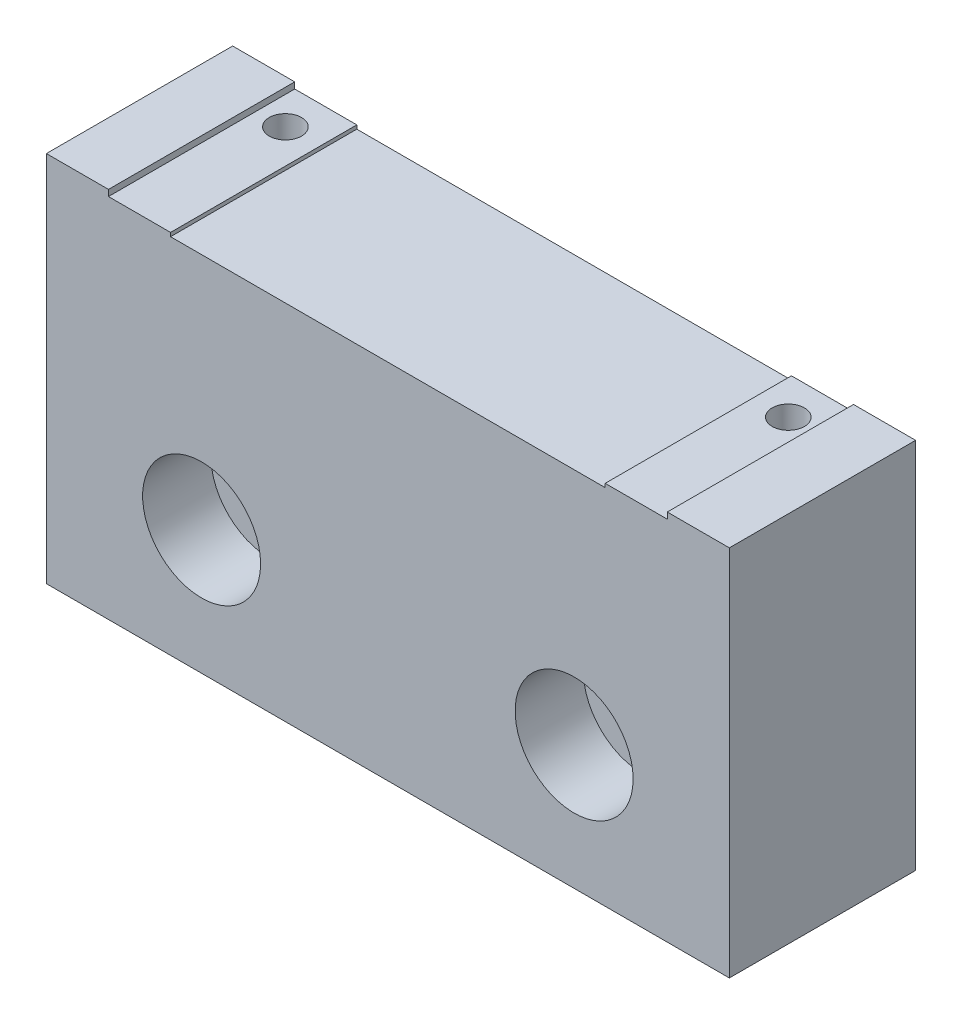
ISO-10303-21;
HEADER;
FILE_DESCRIPTION(('STEP AP214'),'2;1');
FILE_NAME('part.step','',(''),(''),'','','');
FILE_SCHEMA(('AUTOMOTIVE_DESIGN { 1 0 10303 214 1 1 1 1 }'));
ENDSEC;
DATA;
#1=APPLICATION_CONTEXT('core data for automotive mechanical design processes');
#2=APPLICATION_PROTOCOL_DEFINITION('international standard','automotive_design',2000,#1);
#3=PRODUCT_CONTEXT('',#1,'mechanical');
#4=PRODUCT('Part','Part','',(#3));
#5=PRODUCT_RELATED_PRODUCT_CATEGORY('part','',(#4));
#6=PRODUCT_DEFINITION_FORMATION('','',#4);
#7=PRODUCT_DEFINITION_CONTEXT('part definition',#1,'design');
#8=PRODUCT_DEFINITION('design','',#6,#7);
#9=PRODUCT_DEFINITION_SHAPE('','',#8);
#10=(LENGTH_UNIT() NAMED_UNIT(*) SI_UNIT(.MILLI.,.METRE.));
#11=(NAMED_UNIT(*) PLANE_ANGLE_UNIT() SI_UNIT($,.RADIAN.));
#12=(NAMED_UNIT(*) SI_UNIT($,.STERADIAN.) SOLID_ANGLE_UNIT());
#13=UNCERTAINTY_MEASURE_WITH_UNIT(LENGTH_MEASURE(1.E-05),#10,'distance_accuracy_value','');
#14=(GEOMETRIC_REPRESENTATION_CONTEXT(3) GLOBAL_UNCERTAINTY_ASSIGNED_CONTEXT((#13)) GLOBAL_UNIT_ASSIGNED_CONTEXT((#10,
#11,#12)) REPRESENTATION_CONTEXT('',''));
#15=CARTESIAN_POINT('',(0.,0.,0.));
#16=DIRECTION('',(0.,0.,1.));
#17=DIRECTION('',(1.,0.,0.));
#18=AXIS2_PLACEMENT_3D('',#15,#16,#17);
#19=CARTESIAN_POINT('',(42.5,10.,15.));
#20=DIRECTION('',(0.,0.,-1.));
#21=DIRECTION('',(-1.,0.,0.));
#22=AXIS2_PLACEMENT_3D('',#19,#20,#21);
#23=CYLINDRICAL_SURFACE('',#22,2.75);
#24=CARTESIAN_POINT('',(42.5,10.,0.));
#25=DIRECTION('',(0.,0.,1.));
#26=DIRECTION('',(1.,0.,0.));
#27=AXIS2_PLACEMENT_3D('',#24,#25,#26);
#28=CIRCLE('',#27,2.75);
#29=CARTESIAN_POINT('',(45.25,10.,0.));
#30=VERTEX_POINT('',#29);
#31=EDGE_CURVE('E205',#30,#30,#28,.T.);
#32=ORIENTED_EDGE('',*,*,#31,.F.);
#33=EDGE_LOOP('',(#32));
#34=FACE_BOUND('',#33,.T.);
#35=CARTESIAN_POINT('',(42.5,10.,9.5));
#36=DIRECTION('',(0.,0.,1.));
#37=DIRECTION('',(1.,0.,0.));
#38=AXIS2_PLACEMENT_3D('',#35,#36,#37);
#39=CIRCLE('',#38,2.75);
#40=CARTESIAN_POINT('',(45.25,10.,9.5));
#41=VERTEX_POINT('',#40);
#42=EDGE_CURVE('E207',#41,#41,#39,.T.);
#43=ORIENTED_EDGE('',*,*,#42,.T.);
#44=EDGE_LOOP('',(#43));
#45=FACE_BOUND('',#44,.T.);
#46=ADVANCED_FACE('F32',(#34,#45),#23,.F.);
#47=CARTESIAN_POINT('',(12.5,10.,15.));
#48=DIRECTION('',(0.,0.,-1.));
#49=DIRECTION('',(-1.,0.,0.));
#50=AXIS2_PLACEMENT_3D('',#47,#48,#49);
#51=CYLINDRICAL_SURFACE('',#50,2.75);
#52=CARTESIAN_POINT('',(12.5,10.,0.));
#53=DIRECTION('',(0.,0.,1.));
#54=DIRECTION('',(1.,0.,0.));
#55=AXIS2_PLACEMENT_3D('',#52,#53,#54);
#56=CIRCLE('',#55,2.75);
#57=CARTESIAN_POINT('',(15.25,10.,0.));
#58=VERTEX_POINT('',#57);
#59=EDGE_CURVE('E159',#58,#58,#56,.T.);
#60=ORIENTED_EDGE('',*,*,#59,.F.);
#61=EDGE_LOOP('',(#60));
#62=FACE_BOUND('',#61,.T.);
#63=CARTESIAN_POINT('',(12.5,10.,9.5));
#64=DIRECTION('',(0.,0.,1.));
#65=DIRECTION('',(1.,0.,0.));
#66=AXIS2_PLACEMENT_3D('',#63,#64,#65);
#67=CIRCLE('',#66,2.75);
#68=CARTESIAN_POINT('',(15.25,10.,9.5));
#69=VERTEX_POINT('',#68);
#70=EDGE_CURVE('E202',#69,#69,#67,.T.);
#71=ORIENTED_EDGE('',*,*,#70,.T.);
#72=EDGE_LOOP('',(#71));
#73=FACE_BOUND('',#72,.T.);
#74=ADVANCED_FACE('F282',(#62,#73),#51,.F.);
#75=CARTESIAN_POINT('',(55.,0.,15.));
#76=DIRECTION('',(0.,0.,1.));
#77=DIRECTION('',(1.,0.,0.));
#78=AXIS2_PLACEMENT_3D('',#75,#76,#77);
#79=PLANE('',#78);
#80=CARTESIAN_POINT('',(42.5,10.,15.));
#81=DIRECTION('',(0.,0.,1.));
#82=DIRECTION('',(1.,0.,0.));
#83=AXIS2_PLACEMENT_3D('',#80,#81,#82);
#84=CIRCLE('',#83,4.75);
#85=CARTESIAN_POINT('',(47.25,10.,15.));
#86=VERTEX_POINT('',#85);
#87=EDGE_CURVE('E213',#86,#86,#84,.T.);
#88=ORIENTED_EDGE('',*,*,#87,.F.);
#89=EDGE_LOOP('',(#88));
#90=FACE_BOUND('',#89,.T.);
#91=CARTESIAN_POINT('',(12.5,10.,15.));
#92=DIRECTION('',(0.,0.,1.));
#93=DIRECTION('',(1.,0.,0.));
#94=AXIS2_PLACEMENT_3D('',#91,#92,#93);
#95=CIRCLE('',#94,4.75);
#96=CARTESIAN_POINT('',(17.25,10.,15.));
#97=VERTEX_POINT('',#96);
#98=EDGE_CURVE('E209',#97,#97,#95,.T.);
#99=ORIENTED_EDGE('',*,*,#98,.F.);
#100=EDGE_LOOP('',(#99));
#101=FACE_BOUND('',#100,.T.);
#102=DIRECTION('',(1.,0.,0.));
#103=VECTOR('',#102,1.);
#104=CARTESIAN_POINT('',(0.,0.,15.));
#105=LINE('',#104,#103);
#106=CARTESIAN_POINT('',(0.,0.,15.));
#107=VERTEX_POINT('',#106);
#108=CARTESIAN_POINT('',(55.,0.,15.));
#109=VERTEX_POINT('',#108);
#110=EDGE_CURVE('E178',#107,#109,#105,.T.);
#111=ORIENTED_EDGE('',*,*,#110,.T.);
#112=DIRECTION('',(0.,1.,0.));
#113=VECTOR('',#112,1.);
#114=CARTESIAN_POINT('',(55.,0.,15.));
#115=LINE('',#114,#113);
#116=CARTESIAN_POINT('',(55.,30.,15.));
#117=VERTEX_POINT('',#116);
#118=EDGE_CURVE('E106',#109,#117,#115,.T.);
#119=ORIENTED_EDGE('',*,*,#118,.T.);
#120=DIRECTION('',(-1.,0.,0.));
#121=VECTOR('',#120,1.);
#122=CARTESIAN_POINT('',(50.,30.,15.));
#123=LINE('',#122,#121);
#124=CARTESIAN_POINT('',(50.,30.,15.));
#125=VERTEX_POINT('',#124);
#126=EDGE_CURVE('E239',#117,#125,#123,.T.);
#127=ORIENTED_EDGE('',*,*,#126,.T.);
#128=DIRECTION('',(0.,-1.,0.));
#129=VECTOR('',#128,1.);
#130=CARTESIAN_POINT('',(50.,29.5,15.));
#131=LINE('',#130,#129);
#132=CARTESIAN_POINT('',(50.,29.5,15.));
#133=VERTEX_POINT('',#132);
#134=EDGE_CURVE('E241',#125,#133,#131,.T.);
#135=ORIENTED_EDGE('',*,*,#134,.T.);
#136=DIRECTION('',(-1.,0.,0.));
#137=VECTOR('',#136,1.);
#138=CARTESIAN_POINT('',(45.,29.4999999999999,15.));
#139=LINE('',#138,#137);
#140=CARTESIAN_POINT('',(45.,29.4999999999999,15.));
#141=VERTEX_POINT('',#140);
#142=EDGE_CURVE('E243',#133,#141,#139,.T.);
#143=ORIENTED_EDGE('',*,*,#142,.T.);
#144=DIRECTION('',(0.,-1.,0.));
#145=VECTOR('',#144,1.);
#146=CARTESIAN_POINT('',(45.,29.2,15.));
#147=LINE('',#146,#145);
#148=CARTESIAN_POINT('',(45.,29.2,15.));
#149=VERTEX_POINT('',#148);
#150=EDGE_CURVE('E245',#141,#149,#147,.T.);
#151=ORIENTED_EDGE('',*,*,#150,.T.);
#152=DIRECTION('',(-1.,0.,0.));
#153=VECTOR('',#152,1.);
#154=CARTESIAN_POINT('',(10.,29.2,15.));
#155=LINE('',#154,#153);
#156=CARTESIAN_POINT('',(10.,29.2,15.));
#157=VERTEX_POINT('',#156);
#158=EDGE_CURVE('E247',#149,#157,#155,.T.);
#159=ORIENTED_EDGE('',*,*,#158,.T.);
#160=DIRECTION('',(0.,1.,0.));
#161=VECTOR('',#160,1.);
#162=CARTESIAN_POINT('',(10.,29.2,15.));
#163=LINE('',#162,#161);
#164=CARTESIAN_POINT('',(10.,29.5,15.));
#165=VERTEX_POINT('',#164);
#166=EDGE_CURVE('E249',#157,#165,#163,.T.);
#167=ORIENTED_EDGE('',*,*,#166,.T.);
#168=DIRECTION('',(-1.,0.,0.));
#169=VECTOR('',#168,1.);
#170=CARTESIAN_POINT('',(5.,29.5,15.));
#171=LINE('',#170,#169);
#172=CARTESIAN_POINT('',(5.,29.5,15.));
#173=VERTEX_POINT('',#172);
#174=EDGE_CURVE('E137',#165,#173,#171,.T.);
#175=ORIENTED_EDGE('',*,*,#174,.T.);
#176=DIRECTION('',(0.,1.,0.));
#177=VECTOR('',#176,1.);
#178=CARTESIAN_POINT('',(5.,29.5,15.));
#179=LINE('',#178,#177);
#180=CARTESIAN_POINT('',(5.,30.,15.));
#181=VERTEX_POINT('',#180);
#182=EDGE_CURVE('E131',#173,#181,#179,.T.);
#183=ORIENTED_EDGE('',*,*,#182,.T.);
#184=DIRECTION('',(-1.,0.,0.));
#185=VECTOR('',#184,1.);
#186=CARTESIAN_POINT('',(0.,30.,15.));
#187=LINE('',#186,#185);
#188=CARTESIAN_POINT('',(0.,30.,15.));
#189=VERTEX_POINT('',#188);
#190=EDGE_CURVE('E135',#181,#189,#187,.T.);
#191=ORIENTED_EDGE('',*,*,#190,.T.);
#192=DIRECTION('',(0.,-1.,0.));
#193=VECTOR('',#192,1.);
#194=CARTESIAN_POINT('',(0.,0.,15.));
#195=LINE('',#194,#193);
#196=EDGE_CURVE('E51',#189,#107,#195,.T.);
#197=ORIENTED_EDGE('',*,*,#196,.T.);
#198=EDGE_LOOP('',(#111,#119,#127,#135,#143,#151,#159,#167,#175,#183,#191,#197));
#199=FACE_BOUND('',#198,.T.);
#200=ADVANCED_FACE('F133',(#90,#101,#199),#79,.T.);
#201=CARTESIAN_POINT('',(55.,0.,0.));
#202=DIRECTION('',(0.,0.,1.));
#203=DIRECTION('',(1.,0.,0.));
#204=AXIS2_PLACEMENT_3D('',#201,#202,#203);
#205=PLANE('',#204);
#206=ORIENTED_EDGE('',*,*,#59,.T.);
#207=EDGE_LOOP('',(#206));
#208=FACE_BOUND('',#207,.T.);
#209=DIRECTION('',(1.,0.,0.));
#210=VECTOR('',#209,1.);
#211=CARTESIAN_POINT('',(0.,0.,0.));
#212=LINE('',#211,#210);
#213=CARTESIAN_POINT('',(0.,0.,0.));
#214=VERTEX_POINT('',#213);
#215=CARTESIAN_POINT('',(55.,0.,0.));
#216=VERTEX_POINT('',#215);
#217=EDGE_CURVE('E155',#214,#216,#212,.T.);
#218=ORIENTED_EDGE('',*,*,#217,.F.);
#219=DIRECTION('',(0.,-1.,0.));
#220=VECTOR('',#219,1.);
#221=CARTESIAN_POINT('',(0.,0.,0.));
#222=LINE('',#221,#220);
#223=CARTESIAN_POINT('',(0.,30.,0.));
#224=VERTEX_POINT('',#223);
#225=EDGE_CURVE('E98',#224,#214,#222,.T.);
#226=ORIENTED_EDGE('',*,*,#225,.F.);
#227=DIRECTION('',(-1.,0.,0.));
#228=VECTOR('',#227,1.);
#229=CARTESIAN_POINT('',(0.,30.,0.));
#230=LINE('',#229,#228);
#231=CARTESIAN_POINT('',(5.,30.,0.));
#232=VERTEX_POINT('',#231);
#233=EDGE_CURVE('E92',#232,#224,#230,.T.);
#234=ORIENTED_EDGE('',*,*,#233,.F.);
#235=DIRECTION('',(0.,1.,0.));
#236=VECTOR('',#235,1.);
#237=CARTESIAN_POINT('',(5.,29.5,0.));
#238=LINE('',#237,#236);
#239=CARTESIAN_POINT('',(5.,29.5,0.));
#240=VERTEX_POINT('',#239);
#241=EDGE_CURVE('E145',#240,#232,#238,.T.);
#242=ORIENTED_EDGE('',*,*,#241,.F.);
#243=DIRECTION('',(-1.,0.,0.));
#244=VECTOR('',#243,1.);
#245=CARTESIAN_POINT('',(5.,29.5,0.));
#246=LINE('',#245,#244);
#247=CARTESIAN_POINT('',(10.,29.5,0.));
#248=VERTEX_POINT('',#247);
#249=EDGE_CURVE('E173',#248,#240,#246,.T.);
#250=ORIENTED_EDGE('',*,*,#249,.F.);
#251=DIRECTION('',(0.,1.,0.));
#252=VECTOR('',#251,1.);
#253=CARTESIAN_POINT('',(10.,29.2,0.));
#254=LINE('',#253,#252);
#255=CARTESIAN_POINT('',(10.,29.2,0.));
#256=VERTEX_POINT('',#255);
#257=EDGE_CURVE('E171',#256,#248,#254,.T.);
#258=ORIENTED_EDGE('',*,*,#257,.F.);
#259=DIRECTION('',(-1.,0.,0.));
#260=VECTOR('',#259,1.);
#261=CARTESIAN_POINT('',(10.,29.2,0.));
#262=LINE('',#261,#260);
#263=CARTESIAN_POINT('',(45.,29.2,0.));
#264=VERTEX_POINT('',#263);
#265=EDGE_CURVE('E169',#264,#256,#262,.T.);
#266=ORIENTED_EDGE('',*,*,#265,.F.);
#267=DIRECTION('',(0.,-1.,0.));
#268=VECTOR('',#267,1.);
#269=CARTESIAN_POINT('',(45.,29.2,0.));
#270=LINE('',#269,#268);
#271=CARTESIAN_POINT('',(45.,29.4999999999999,0.));
#272=VERTEX_POINT('',#271);
#273=EDGE_CURVE('E167',#272,#264,#270,.T.);
#274=ORIENTED_EDGE('',*,*,#273,.F.);
#275=DIRECTION('',(-1.,0.,0.));
#276=VECTOR('',#275,1.);
#277=CARTESIAN_POINT('',(45.,29.4999999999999,0.));
#278=LINE('',#277,#276);
#279=CARTESIAN_POINT('',(50.,29.5,0.));
#280=VERTEX_POINT('',#279);
#281=EDGE_CURVE('E165',#280,#272,#278,.T.);
#282=ORIENTED_EDGE('',*,*,#281,.F.);
#283=DIRECTION('',(0.,-1.,0.));
#284=VECTOR('',#283,1.);
#285=CARTESIAN_POINT('',(50.,29.5,0.));
#286=LINE('',#285,#284);
#287=CARTESIAN_POINT('',(50.,30.,0.));
#288=VERTEX_POINT('',#287);
#289=EDGE_CURVE('E163',#288,#280,#286,.T.);
#290=ORIENTED_EDGE('',*,*,#289,.F.);
#291=DIRECTION('',(-1.,0.,0.));
#292=VECTOR('',#291,1.);
#293=CARTESIAN_POINT('',(50.,30.,0.));
#294=LINE('',#293,#292);
#295=CARTESIAN_POINT('',(55.,30.,0.));
#296=VERTEX_POINT('',#295);
#297=EDGE_CURVE('E161',#296,#288,#294,.T.);
#298=ORIENTED_EDGE('',*,*,#297,.F.);
#299=DIRECTION('',(0.,1.,0.));
#300=VECTOR('',#299,1.);
#301=CARTESIAN_POINT('',(55.,0.,0.));
#302=LINE('',#301,#300);
#303=EDGE_CURVE('E158',#216,#296,#302,.T.);
#304=ORIENTED_EDGE('',*,*,#303,.F.);
#305=EDGE_LOOP('',(#218,#226,#234,#242,#250,#258,#266,#274,#282,#290,#298,#304));
#306=FACE_BOUND('',#305,.T.);
#307=ORIENTED_EDGE('',*,*,#31,.T.);
#308=EDGE_LOOP('',(#307));
#309=FACE_BOUND('',#308,.T.);
#310=ADVANCED_FACE('F262',(#208,#306,#309),#205,.F.);
#311=CARTESIAN_POINT('',(0.,0.,15.));
#312=DIRECTION('',(0.,1.,0.));
#313=DIRECTION('',(0.,0.,1.));
#314=AXIS2_PLACEMENT_3D('',#311,#312,#313);
#315=PLANE('',#314);
#316=CARTESIAN_POINT('',(7.2587228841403,0.,3.0120402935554));
#317=DIRECTION('',(0.,1.,0.));
#318=DIRECTION('',(0.,0.,1.));
#319=AXIS2_PLACEMENT_3D('',#316,#317,#318);
#320=CIRCLE('',#319,1.3);
#321=CARTESIAN_POINT('',(7.2587228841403,0.,4.3120402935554));
#322=VERTEX_POINT('',#321);
#323=EDGE_CURVE('E224',#322,#322,#320,.T.);
#324=ORIENTED_EDGE('',*,*,#323,.T.);
#325=EDGE_LOOP('',(#324));
#326=FACE_BOUND('',#325,.T.);
#327=CARTESIAN_POINT('',(47.7587228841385,0.,3.0120402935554));
#328=DIRECTION('',(0.,1.,0.));
#329=DIRECTION('',(0.,0.,1.));
#330=AXIS2_PLACEMENT_3D('',#327,#328,#329);
#331=CIRCLE('',#330,1.3);
#332=CARTESIAN_POINT('',(47.7587228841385,0.,4.3120402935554));
#333=VERTEX_POINT('',#332);
#334=EDGE_CURVE('E214',#333,#333,#331,.T.);
#335=ORIENTED_EDGE('',*,*,#334,.T.);
#336=EDGE_LOOP('',(#335));
#337=FACE_BOUND('',#336,.T.);
#338=ORIENTED_EDGE('',*,*,#217,.T.);
#339=DIRECTION('',(0.,0.,-1.));
#340=VECTOR('',#339,1.);
#341=CARTESIAN_POINT('',(55.,0.,15.));
#342=LINE('',#341,#340);
#343=EDGE_CURVE('E11',#109,#216,#342,.T.);
#344=ORIENTED_EDGE('',*,*,#343,.F.);
#345=ORIENTED_EDGE('',*,*,#110,.F.);
#346=DIRECTION('',(0.,0.,-1.));
#347=VECTOR('',#346,1.);
#348=CARTESIAN_POINT('',(0.,0.,15.));
#349=LINE('',#348,#347);
#350=EDGE_CURVE('E151',#107,#214,#349,.T.);
#351=ORIENTED_EDGE('',*,*,#350,.T.);
#352=EDGE_LOOP('',(#338,#344,#345,#351));
#353=FACE_BOUND('',#352,.T.);
#354=ADVANCED_FACE('F34',(#326,#337,#353),#315,.F.);
#355=CARTESIAN_POINT('',(55.,0.,15.));
#356=DIRECTION('',(-1.,0.,0.));
#357=DIRECTION('',(0.,0.,1.));
#358=AXIS2_PLACEMENT_3D('',#355,#356,#357);
#359=PLANE('',#358);
#360=ORIENTED_EDGE('',*,*,#303,.T.);
#361=DIRECTION('',(0.,0.,-1.));
#362=VECTOR('',#361,1.);
#363=CARTESIAN_POINT('',(55.,30.,15.));
#364=LINE('',#363,#362);
#365=EDGE_CURVE('E42',#117,#296,#364,.T.);
#366=ORIENTED_EDGE('',*,*,#365,.F.);
#367=ORIENTED_EDGE('',*,*,#118,.F.);
#368=ORIENTED_EDGE('',*,*,#343,.T.);
#369=EDGE_LOOP('',(#360,#366,#367,#368));
#370=FACE_BOUND('',#369,.T.);
#371=ADVANCED_FACE('F301',(#370),#359,.F.);
#372=CARTESIAN_POINT('',(50.,30.,15.));
#373=DIRECTION('',(0.,-1.,0.));
#374=DIRECTION('',(0.,0.,-1.));
#375=AXIS2_PLACEMENT_3D('',#372,#373,#374);
#376=PLANE('',#375);
#377=ORIENTED_EDGE('',*,*,#297,.T.);
#378=DIRECTION('',(0.,0.,-1.));
#379=VECTOR('',#378,1.);
#380=CARTESIAN_POINT('',(50.,30.,15.));
#381=LINE('',#380,#379);
#382=EDGE_CURVE('E197',#125,#288,#381,.T.);
#383=ORIENTED_EDGE('',*,*,#382,.F.);
#384=ORIENTED_EDGE('',*,*,#126,.F.);
#385=ORIENTED_EDGE('',*,*,#365,.T.);
#386=EDGE_LOOP('',(#377,#383,#384,#385));
#387=FACE_BOUND('',#386,.T.);
#388=ADVANCED_FACE('F361',(#387),#376,.F.);
#389=CARTESIAN_POINT('',(50.,29.5,15.));
#390=DIRECTION('',(1.,0.,0.));
#391=DIRECTION('',(0.,0.,-1.));
#392=AXIS2_PLACEMENT_3D('',#389,#390,#391);
#393=PLANE('',#392);
#394=ORIENTED_EDGE('',*,*,#289,.T.);
#395=DIRECTION('',(0.,0.,-1.));
#396=VECTOR('',#395,1.);
#397=CARTESIAN_POINT('',(50.,29.5,15.));
#398=LINE('',#397,#396);
#399=EDGE_CURVE('E194',#133,#280,#398,.T.);
#400=ORIENTED_EDGE('',*,*,#399,.F.);
#401=ORIENTED_EDGE('',*,*,#134,.F.);
#402=ORIENTED_EDGE('',*,*,#382,.T.);
#403=EDGE_LOOP('',(#394,#400,#401,#402));
#404=FACE_BOUND('',#403,.T.);
#405=ADVANCED_FACE('F358',(#404),#393,.F.);
#406=CARTESIAN_POINT('',(45.,29.4999999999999,15.));
#407=DIRECTION('',(0.,-1.,0.));
#408=DIRECTION('',(1.,0.,0.));
#409=AXIS2_PLACEMENT_3D('',#406,#407,#408);
#410=PLANE('',#409);
#411=CARTESIAN_POINT('',(47.7587228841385,29.5,3.0120402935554));
#412=DIRECTION('',(0.,-1.,0.));
#413=DIRECTION('',(1.,0.,0.));
#414=AXIS2_PLACEMENT_3D('',#411,#412,#413);
#415=CIRCLE('',#414,1.3);
#416=CARTESIAN_POINT('',(49.0587228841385,29.5,3.0120402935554));
#417=VERTEX_POINT('',#416);
#418=EDGE_CURVE('E211',#417,#417,#415,.T.);
#419=ORIENTED_EDGE('',*,*,#418,.T.);
#420=EDGE_LOOP('',(#419));
#421=FACE_BOUND('',#420,.T.);
#422=ORIENTED_EDGE('',*,*,#281,.T.);
#423=DIRECTION('',(0.,0.,-1.));
#424=VECTOR('',#423,1.);
#425=CARTESIAN_POINT('',(45.,29.4999999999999,15.));
#426=LINE('',#425,#424);
#427=EDGE_CURVE('E191',#141,#272,#426,.T.);
#428=ORIENTED_EDGE('',*,*,#427,.F.);
#429=ORIENTED_EDGE('',*,*,#142,.F.);
#430=ORIENTED_EDGE('',*,*,#399,.T.);
#431=EDGE_LOOP('',(#422,#428,#429,#430));
#432=FACE_BOUND('',#431,.T.);
#433=ADVANCED_FACE('F354',(#421,#432),#410,.F.);
#434=CARTESIAN_POINT('',(45.,29.2,15.));
#435=DIRECTION('',(1.,0.,0.));
#436=DIRECTION('',(0.,0.,-1.));
#437=AXIS2_PLACEMENT_3D('',#434,#435,#436);
#438=PLANE('',#437);
#439=ORIENTED_EDGE('',*,*,#273,.T.);
#440=DIRECTION('',(0.,0.,-1.));
#441=VECTOR('',#440,1.);
#442=CARTESIAN_POINT('',(45.,29.2,15.));
#443=LINE('',#442,#441);
#444=EDGE_CURVE('E188',#149,#264,#443,.T.);
#445=ORIENTED_EDGE('',*,*,#444,.F.);
#446=ORIENTED_EDGE('',*,*,#150,.F.);
#447=ORIENTED_EDGE('',*,*,#427,.T.);
#448=EDGE_LOOP('',(#439,#445,#446,#447));
#449=FACE_BOUND('',#448,.T.);
#450=ADVANCED_FACE('F350',(#449),#438,.F.);
#451=CARTESIAN_POINT('',(10.,29.2,15.));
#452=DIRECTION('',(0.,-1.,0.));
#453=DIRECTION('',(0.,0.,-1.));
#454=AXIS2_PLACEMENT_3D('',#451,#452,#453);
#455=PLANE('',#454);
#456=ORIENTED_EDGE('',*,*,#265,.T.);
#457=DIRECTION('',(0.,0.,-1.));
#458=VECTOR('',#457,1.);
#459=CARTESIAN_POINT('',(10.,29.2,15.));
#460=LINE('',#459,#458);
#461=EDGE_CURVE('E185',#157,#256,#460,.T.);
#462=ORIENTED_EDGE('',*,*,#461,.F.);
#463=ORIENTED_EDGE('',*,*,#158,.F.);
#464=ORIENTED_EDGE('',*,*,#444,.T.);
#465=EDGE_LOOP('',(#456,#462,#463,#464));
#466=FACE_BOUND('',#465,.T.);
#467=ADVANCED_FACE('F345',(#466),#455,.F.);
#468=CARTESIAN_POINT('',(10.,29.2,15.));
#469=DIRECTION('',(-1.,0.,0.));
#470=DIRECTION('',(0.,0.,1.));
#471=AXIS2_PLACEMENT_3D('',#468,#469,#470);
#472=PLANE('',#471);
#473=ORIENTED_EDGE('',*,*,#257,.T.);
#474=DIRECTION('',(0.,0.,-1.));
#475=VECTOR('',#474,1.);
#476=CARTESIAN_POINT('',(10.,29.5,15.));
#477=LINE('',#476,#475);
#478=EDGE_CURVE('E182',#165,#248,#477,.T.);
#479=ORIENTED_EDGE('',*,*,#478,.F.);
#480=ORIENTED_EDGE('',*,*,#166,.F.);
#481=ORIENTED_EDGE('',*,*,#461,.T.);
#482=EDGE_LOOP('',(#473,#479,#480,#481));
#483=FACE_BOUND('',#482,.T.);
#484=ADVANCED_FACE('F255',(#483),#472,.F.);
#485=CARTESIAN_POINT('',(5.,29.5,15.));
#486=DIRECTION('',(0.,-1.,0.));
#487=DIRECTION('',(0.,0.,-1.));
#488=AXIS2_PLACEMENT_3D('',#485,#486,#487);
#489=PLANE('',#488);
#490=CARTESIAN_POINT('',(7.2587228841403,29.5,3.0120402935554));
#491=DIRECTION('',(0.,-1.,0.));
#492=DIRECTION('',(0.,0.,-1.));
#493=AXIS2_PLACEMENT_3D('',#490,#491,#492);
#494=CIRCLE('',#493,1.3);
#495=CARTESIAN_POINT('',(7.2587228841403,29.5,1.7120402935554));
#496=VERTEX_POINT('',#495);
#497=EDGE_CURVE('E36',#496,#496,#494,.T.);
#498=ORIENTED_EDGE('',*,*,#497,.T.);
#499=EDGE_LOOP('',(#498));
#500=FACE_BOUND('',#499,.T.);
#501=ORIENTED_EDGE('',*,*,#249,.T.);
#502=DIRECTION('',(0.,0.,-1.));
#503=VECTOR('',#502,1.);
#504=CARTESIAN_POINT('',(5.,29.5,15.));
#505=LINE('',#504,#503);
#506=EDGE_CURVE('E146',#173,#240,#505,.T.);
#507=ORIENTED_EDGE('',*,*,#506,.F.);
#508=ORIENTED_EDGE('',*,*,#174,.F.);
#509=ORIENTED_EDGE('',*,*,#478,.T.);
#510=EDGE_LOOP('',(#501,#507,#508,#509));
#511=FACE_BOUND('',#510,.T.);
#512=ADVANCED_FACE('F259',(#500,#511),#489,.F.);
#513=CARTESIAN_POINT('',(5.,29.5,15.));
#514=DIRECTION('',(-1.,0.,0.));
#515=DIRECTION('',(0.,0.,1.));
#516=AXIS2_PLACEMENT_3D('',#513,#514,#515);
#517=PLANE('',#516);
#518=ORIENTED_EDGE('',*,*,#241,.T.);
#519=DIRECTION('',(0.,0.,-1.));
#520=VECTOR('',#519,1.);
#521=CARTESIAN_POINT('',(5.,30.,15.));
#522=LINE('',#521,#520);
#523=EDGE_CURVE('E142',#181,#232,#522,.T.);
#524=ORIENTED_EDGE('',*,*,#523,.F.);
#525=ORIENTED_EDGE('',*,*,#182,.F.);
#526=ORIENTED_EDGE('',*,*,#506,.T.);
#527=EDGE_LOOP('',(#518,#524,#525,#526));
#528=FACE_BOUND('',#527,.T.);
#529=ADVANCED_FACE('F143',(#528),#517,.F.);
#530=CARTESIAN_POINT('',(0.,30.,15.));
#531=DIRECTION('',(0.,-1.,0.));
#532=DIRECTION('',(0.,0.,-1.));
#533=AXIS2_PLACEMENT_3D('',#530,#531,#532);
#534=PLANE('',#533);
#535=ORIENTED_EDGE('',*,*,#233,.T.);
#536=DIRECTION('',(0.,0.,-1.));
#537=VECTOR('',#536,1.);
#538=CARTESIAN_POINT('',(0.,30.,15.));
#539=LINE('',#538,#537);
#540=EDGE_CURVE('E147',#189,#224,#539,.T.);
#541=ORIENTED_EDGE('',*,*,#540,.F.);
#542=ORIENTED_EDGE('',*,*,#190,.F.);
#543=ORIENTED_EDGE('',*,*,#523,.T.);
#544=EDGE_LOOP('',(#535,#541,#542,#543));
#545=FACE_BOUND('',#544,.T.);
#546=ADVANCED_FACE('F149',(#545),#534,.F.);
#547=CARTESIAN_POINT('',(0.,0.,15.));
#548=DIRECTION('',(1.,0.,0.));
#549=DIRECTION('',(0.,0.,-1.));
#550=AXIS2_PLACEMENT_3D('',#547,#548,#549);
#551=PLANE('',#550);
#552=ORIENTED_EDGE('',*,*,#225,.T.);
#553=ORIENTED_EDGE('',*,*,#350,.F.);
#554=ORIENTED_EDGE('',*,*,#196,.F.);
#555=ORIENTED_EDGE('',*,*,#540,.T.);
#556=EDGE_LOOP('',(#552,#553,#554,#555));
#557=FACE_BOUND('',#556,.T.);
#558=ADVANCED_FACE('F268',(#557),#551,.F.);
#559=CARTESIAN_POINT('',(12.5,10.,9.5));
#560=DIRECTION('',(0.,0.,1.));
#561=DIRECTION('',(1.,0.,0.));
#562=AXIS2_PLACEMENT_3D('',#559,#560,#561);
#563=CYLINDRICAL_SURFACE('',#562,4.75);
#564=CARTESIAN_POINT('',(12.5,10.,9.5));
#565=DIRECTION('',(0.,0.,1.));
#566=DIRECTION('',(1.,0.,0.));
#567=AXIS2_PLACEMENT_3D('',#564,#565,#566);
#568=CIRCLE('',#567,4.75);
#569=CARTESIAN_POINT('',(17.25,10.,9.5));
#570=VERTEX_POINT('',#569);
#571=EDGE_CURVE('E206',#570,#570,#568,.T.);
#572=ORIENTED_EDGE('',*,*,#571,.F.);
#573=EDGE_LOOP('',(#572));
#574=FACE_BOUND('',#573,.T.);
#575=ORIENTED_EDGE('',*,*,#98,.T.);
#576=EDGE_LOOP('',(#575));
#577=FACE_BOUND('',#576,.T.);
#578=ADVANCED_FACE('F270',(#574,#577),#563,.F.);
#579=CARTESIAN_POINT('',(12.5,10.,9.5));
#580=DIRECTION('',(0.,0.,1.));
#581=DIRECTION('',(1.,0.,0.));
#582=AXIS2_PLACEMENT_3D('',#579,#580,#581);
#583=PLANE('',#582);
#584=ORIENTED_EDGE('',*,*,#70,.F.);
#585=EDGE_LOOP('',(#584));
#586=FACE_BOUND('',#585,.T.);
#587=ORIENTED_EDGE('',*,*,#571,.T.);
#588=EDGE_LOOP('',(#587));
#589=FACE_BOUND('',#588,.T.);
#590=ADVANCED_FACE('F276',(#586,#589),#583,.T.);
#591=CARTESIAN_POINT('',(42.5,10.,9.5));
#592=DIRECTION('',(0.,0.,1.));
#593=DIRECTION('',(1.,0.,0.));
#594=AXIS2_PLACEMENT_3D('',#591,#592,#593);
#595=CYLINDRICAL_SURFACE('',#594,4.75);
#596=CARTESIAN_POINT('',(42.5,10.,9.5));
#597=DIRECTION('',(0.,0.,1.));
#598=DIRECTION('',(1.,0.,0.));
#599=AXIS2_PLACEMENT_3D('',#596,#597,#598);
#600=CIRCLE('',#599,4.75);
#601=CARTESIAN_POINT('',(47.25,10.,9.5));
#602=VERTEX_POINT('',#601);
#603=EDGE_CURVE('E210',#602,#602,#600,.T.);
#604=ORIENTED_EDGE('',*,*,#603,.F.);
#605=EDGE_LOOP('',(#604));
#606=FACE_BOUND('',#605,.T.);
#607=ORIENTED_EDGE('',*,*,#87,.T.);
#608=EDGE_LOOP('',(#607));
#609=FACE_BOUND('',#608,.T.);
#610=ADVANCED_FACE('F309',(#606,#609),#595,.F.);
#611=CARTESIAN_POINT('',(42.5,10.,9.5));
#612=DIRECTION('',(0.,0.,1.));
#613=DIRECTION('',(1.,0.,0.));
#614=AXIS2_PLACEMENT_3D('',#611,#612,#613);
#615=PLANE('',#614);
#616=ORIENTED_EDGE('',*,*,#42,.F.);
#617=EDGE_LOOP('',(#616));
#618=FACE_BOUND('',#617,.T.);
#619=ORIENTED_EDGE('',*,*,#603,.T.);
#620=EDGE_LOOP('',(#619));
#621=FACE_BOUND('',#620,.T.);
#622=ADVANCED_FACE('F317',(#618,#621),#615,.T.);
#623=CARTESIAN_POINT('',(47.7587228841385,0.,3.0120402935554));
#624=DIRECTION('',(0.,1.,0.));
#625=DIRECTION('',(0.,0.,1.));
#626=AXIS2_PLACEMENT_3D('',#623,#624,#625);
#627=CYLINDRICAL_SURFACE('',#626,1.3);
#628=ORIENTED_EDGE('',*,*,#334,.F.);
#629=EDGE_LOOP('',(#628));
#630=FACE_BOUND('',#629,.T.);
#631=ORIENTED_EDGE('',*,*,#418,.F.);
#632=EDGE_LOOP('',(#631));
#633=FACE_BOUND('',#632,.T.);
#634=ADVANCED_FACE('F323',(#630,#633),#627,.F.);
#635=CARTESIAN_POINT('',(7.2587228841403,0.,3.0120402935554));
#636=DIRECTION('',(0.,1.,0.));
#637=DIRECTION('',(0.,0.,1.));
#638=AXIS2_PLACEMENT_3D('',#635,#636,#637);
#639=CYLINDRICAL_SURFACE('',#638,1.3);
#640=ORIENTED_EDGE('',*,*,#323,.F.);
#641=EDGE_LOOP('',(#640));
#642=FACE_BOUND('',#641,.T.);
#643=ORIENTED_EDGE('',*,*,#497,.F.);
#644=EDGE_LOOP('',(#643));
#645=FACE_BOUND('',#644,.T.);
#646=ADVANCED_FACE('F327',(#642,#645),#639,.F.);
#647=CLOSED_SHELL('',(#46,#74,#200,#310,#354,#371,#388,#405,#433,#450,#467,#484,#512,#529,#546,
#558,#578,#590,#610,#622,#634,#646));
#648=MANIFOLD_SOLID_BREP('B2',#647);
#649=ADVANCED_BREP_SHAPE_REPRESENTATION('',(#18,#648),#14);
#650=SHAPE_DEFINITION_REPRESENTATION(#9,#649);
ENDSEC;
END-ISO-10303-21;
